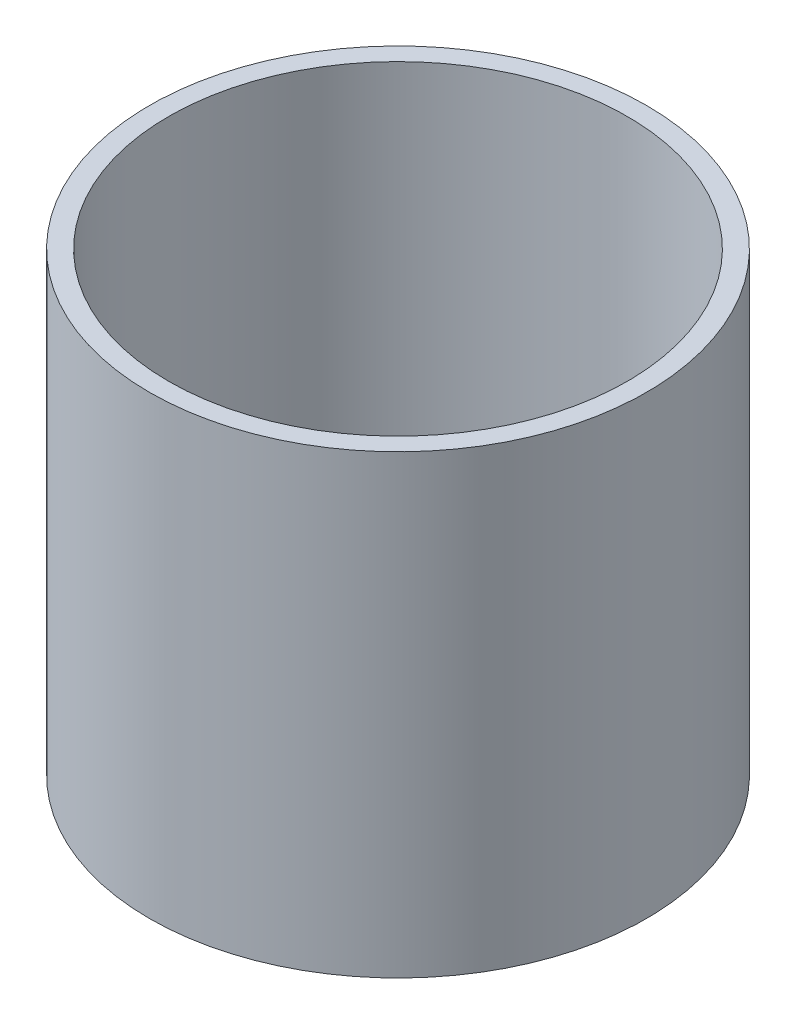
ISO-10303-21;
HEADER;
FILE_DESCRIPTION(('STEP AP214'),'2;1');
FILE_NAME('part.step','',(''),(''),'','','');
FILE_SCHEMA(('AUTOMOTIVE_DESIGN { 1 0 10303 214 1 1 1 1 }'));
ENDSEC;
DATA;
#1=APPLICATION_CONTEXT('core data for automotive mechanical design processes');
#2=APPLICATION_PROTOCOL_DEFINITION('international standard','automotive_design',2000,#1);
#3=PRODUCT_CONTEXT('',#1,'mechanical');
#4=PRODUCT('Part','Part','',(#3));
#5=PRODUCT_RELATED_PRODUCT_CATEGORY('part','',(#4));
#6=PRODUCT_DEFINITION_FORMATION('','',#4);
#7=PRODUCT_DEFINITION_CONTEXT('part definition',#1,'design');
#8=PRODUCT_DEFINITION('design','',#6,#7);
#9=PRODUCT_DEFINITION_SHAPE('','',#8);
#10=(LENGTH_UNIT() NAMED_UNIT(*) SI_UNIT(.MILLI.,.METRE.));
#11=(NAMED_UNIT(*) PLANE_ANGLE_UNIT() SI_UNIT($,.RADIAN.));
#12=(NAMED_UNIT(*) SI_UNIT($,.STERADIAN.) SOLID_ANGLE_UNIT());
#13=UNCERTAINTY_MEASURE_WITH_UNIT(LENGTH_MEASURE(1.E-05),#10,'distance_accuracy_value','');
#14=(GEOMETRIC_REPRESENTATION_CONTEXT(3) GLOBAL_UNCERTAINTY_ASSIGNED_CONTEXT((#13)) GLOBAL_UNIT_ASSIGNED_CONTEXT((#10,
#11,#12)) REPRESENTATION_CONTEXT('',''));
#15=CARTESIAN_POINT('',(0.,0.,0.));
#16=DIRECTION('',(0.,0.,1.));
#17=DIRECTION('',(1.,0.,0.));
#18=AXIS2_PLACEMENT_3D('',#15,#16,#17);
#19=CARTESIAN_POINT('',(0.,85.852,0.));
#20=DIRECTION('',(0.,1.,0.));
#21=DIRECTION('',(0.,0.,1.));
#22=AXIS2_PLACEMENT_3D('',#19,#20,#21);
#23=CYLINDRICAL_SURFACE('',#22,82.55);
#24=CARTESIAN_POINT('',(0.,75.6944000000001,0.));
#25=DIRECTION('',(0.,1.,0.));
#26=DIRECTION('',(0.,0.,1.));
#27=AXIS2_PLACEMENT_3D('',#24,#25,#26);
#28=CIRCLE('',#27,82.55);
#29=CARTESIAN_POINT('',(0.,75.6944000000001,82.55));
#30=VERTEX_POINT('',#29);
#31=EDGE_CURVE('E46',#30,#30,#28,.T.);
#32=ORIENTED_EDGE('',*,*,#31,.F.);
#33=EDGE_LOOP('',(#32));
#34=FACE_BOUND('',#33,.T.);
#35=CARTESIAN_POINT('',(0.,-75.6920000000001,0.));
#36=DIRECTION('',(0.,1.,0.));
#37=DIRECTION('',(0.,0.,1.));
#38=AXIS2_PLACEMENT_3D('',#35,#36,#37);
#39=CIRCLE('',#38,82.55);
#40=CARTESIAN_POINT('',(0.,-75.6920000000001,82.55));
#41=VERTEX_POINT('',#40);
#42=EDGE_CURVE('E10',#41,#41,#39,.T.);
#43=ORIENTED_EDGE('',*,*,#42,.T.);
#44=EDGE_LOOP('',(#43));
#45=FACE_BOUND('',#44,.T.);
#46=ADVANCED_FACE('F32',(#34,#45),#23,.T.);
#47=CARTESIAN_POINT('',(82.55,-75.6920000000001,0.));
#48=DIRECTION('',(0.,1.,0.));
#49=DIRECTION('',(0.,0.,1.));
#50=AXIS2_PLACEMENT_3D('',#47,#48,#49);
#51=PLANE('',#50);
#52=ORIENTED_EDGE('',*,*,#42,.F.);
#53=EDGE_LOOP('',(#52));
#54=FACE_BOUND('',#53,.T.);
#55=CARTESIAN_POINT('',(0.,-75.6920000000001,0.));
#56=DIRECTION('',(0.,1.,0.));
#57=DIRECTION('',(0.,0.,1.));
#58=AXIS2_PLACEMENT_3D('',#55,#56,#57);
#59=CIRCLE('',#58,76.2);
#60=CARTESIAN_POINT('',(0.,-75.6920000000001,76.2));
#61=VERTEX_POINT('',#60);
#62=EDGE_CURVE('E38',#61,#61,#59,.T.);
#63=ORIENTED_EDGE('',*,*,#62,.T.);
#64=EDGE_LOOP('',(#63));
#65=FACE_BOUND('',#64,.T.);
#66=ADVANCED_FACE('F55',(#54,#65),#51,.F.);
#67=CARTESIAN_POINT('',(0.,85.852,0.));
#68=DIRECTION('',(0.,1.,0.));
#69=DIRECTION('',(0.,0.,1.));
#70=AXIS2_PLACEMENT_3D('',#67,#68,#69);
#71=CYLINDRICAL_SURFACE('',#70,76.2);
#72=ORIENTED_EDGE('',*,*,#62,.F.);
#73=EDGE_LOOP('',(#72));
#74=FACE_BOUND('',#73,.T.);
#75=CARTESIAN_POINT('',(0.,75.6944000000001,0.));
#76=DIRECTION('',(0.,1.,0.));
#77=DIRECTION('',(0.,0.,1.));
#78=AXIS2_PLACEMENT_3D('',#75,#76,#77);
#79=CIRCLE('',#78,76.2);
#80=CARTESIAN_POINT('',(0.,75.6944000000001,76.2));
#81=VERTEX_POINT('',#80);
#82=EDGE_CURVE('E42',#81,#81,#79,.T.);
#83=ORIENTED_EDGE('',*,*,#82,.T.);
#84=EDGE_LOOP('',(#83));
#85=FACE_BOUND('',#84,.T.);
#86=ADVANCED_FACE('F59',(#74,#85),#71,.F.);
#87=CARTESIAN_POINT('',(76.2,75.6944000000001,0.));
#88=DIRECTION('',(0.,-1.,0.));
#89=DIRECTION('',(0.,0.,-1.));
#90=AXIS2_PLACEMENT_3D('',#87,#88,#89);
#91=PLANE('',#90);
#92=ORIENTED_EDGE('',*,*,#82,.F.);
#93=EDGE_LOOP('',(#92));
#94=FACE_BOUND('',#93,.T.);
#95=ORIENTED_EDGE('',*,*,#31,.T.);
#96=EDGE_LOOP('',(#95));
#97=FACE_BOUND('',#96,.T.);
#98=ADVANCED_FACE('F52',(#94,#97),#91,.F.);
#99=CLOSED_SHELL('',(#46,#66,#86,#98));
#100=MANIFOLD_SOLID_BREP('B2',#99);
#101=ADVANCED_BREP_SHAPE_REPRESENTATION('',(#18,#100),#14);
#102=SHAPE_DEFINITION_REPRESENTATION(#9,#101);
ENDSEC;
END-ISO-10303-21;
